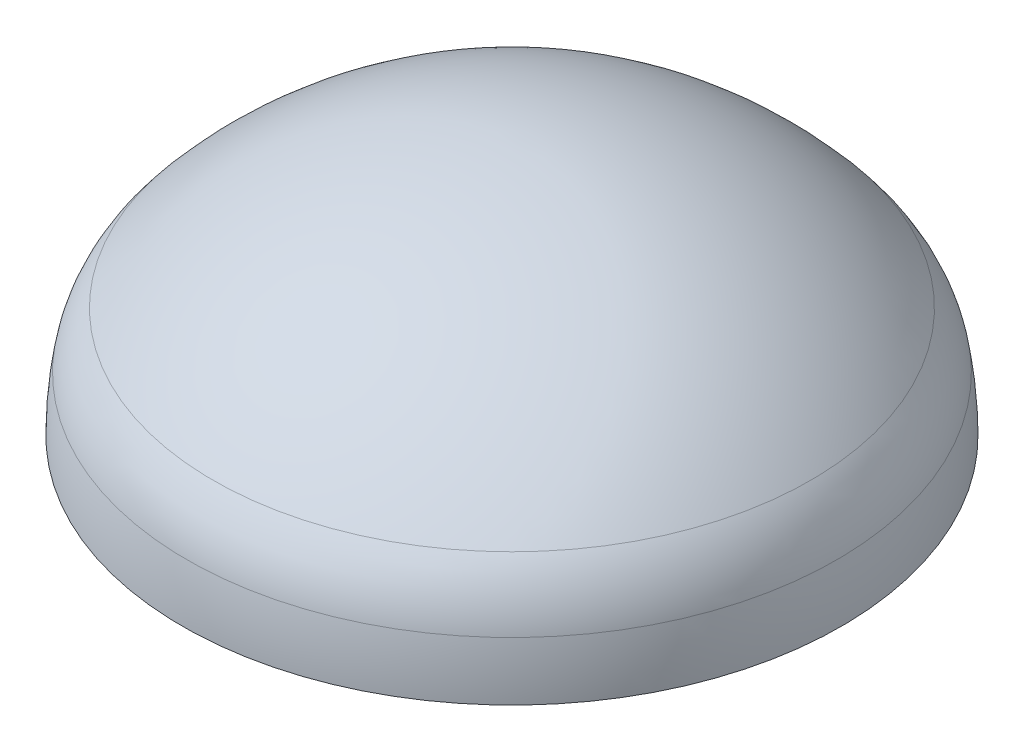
from build123d import *


with BuildPart() as part:
    # Esquisse1 → R_vol.-Mince1 (revolve)
    with BuildSketch(Plane.XY, mode=Mode.PRIVATE) as r_vol_mince1_sk:
        with BuildLine():
            ThreePointArc((0, 21.5), (-14.223220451, 18.382033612), (-25.837763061, 9.6))
            ThreePointArc((-25.837763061, 9.6), (-27.294552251, 7.341047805), (-28.097026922, 4.775675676))
            ThreePointArc((-28.097026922, 4.775675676), (-28.399078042, 2.39632351), (-28.5, 0))
            Line((-28.5, 0), (-27, 0))
            ThreePointArc((-27, 0), (-26.904389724, 2.27020122), (-26.618236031, 4.524324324))
            ThreePointArc((-26.618236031, 4.524324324), (-25.936132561, 6.704890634), (-24.69786175, 8.625))
            ThreePointArc((-24.69786175, 8.625), (-13.595725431, 17.019590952), (0, 20))
            Line((0, 20), (0, 21.5))
        make_face()
    revolve(r_vol_mince1_sk.sketch.rotate(Axis((0, 0, 0), (0, 1, 0)), 270), axis=Axis((0, 0, 0), (0, 1, 0)))


solid = part.part
